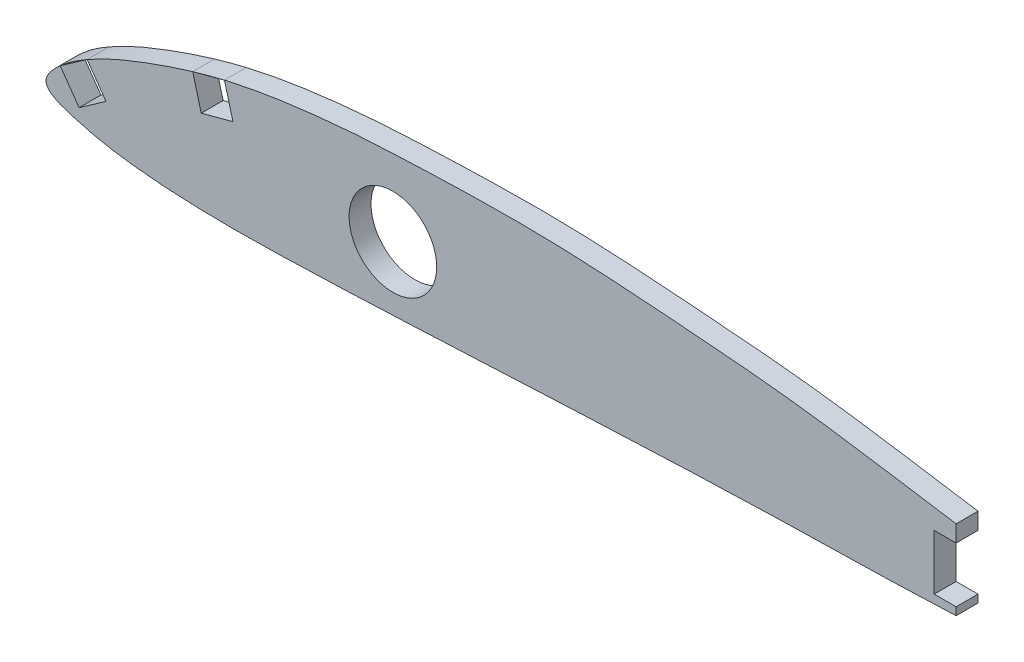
from build123d import *

# Parameters (mm, degrees)
BOSS_EXTRUDE1_DEPTH = 3.175
SKETCH1_R           = 6.35
CUT_EXTRUDE1_DEPTH  = 10


with BuildPart() as part:
    # 3DSketch1 → Boss-Extrude1 (new body)
    with BuildSketch(Plane(origin=(0, 0, 0), x_dir=(0.999981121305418, -0.006144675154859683, 0), z_dir=(0, 0, 1))):
        with BuildLine():
            add(Edge.make_bspline(
                [(0, 0), (-0.055698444, 0.966019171), (2.041050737, 3.148203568), (5.024824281, 5.313067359), (8.896258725, 7.428588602), (16.316218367, 10.50008854), (25.321932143, 13.434493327), (35.99259414, 15.208232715), (45.039943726, 16.167310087), (57.087137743, 16.746385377), (72.162542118, 17.266692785), (90.21659387, 16.111019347), (108.401858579, 14.806394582), (126.183465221, 12.069874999), (145.257463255, 9.273760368), (159.821399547, 5.941828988), (190.816250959, 0), (150.75216978, 1.164714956), (133.342814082, -0.536451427), (95.743205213, -1.360288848), (66.358712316, -3.142575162), (36.102738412, -4.647724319), (21.231058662, -4.982995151), (10.277162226, -3.989977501), (4.696184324, -2.749927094), (0.076432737, -1.325629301), (0, 0)],
                knots=[0, 0, 0, 0, 0.010560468, 0.018211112, 0.032209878, 0.045524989, 0.084069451, 0.108974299, 0.133649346, 0.158232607, 0.207343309, 0.256522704, 0.305826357, 0.355445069, 0.405214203, 0.45539047, 0.506006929, 0.555121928, 0.653369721, 0.702490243, 0.849938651, 0.899083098, 0.948194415, 0.97290595, 0.985508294, 1, 1, 1, 1], degree=3))
        make_face()
    extrude(amount=BOSS_EXTRUDE1_DEPTH)

    # Sketch1 → Cut-Extrude1 (cut)
    with BuildSketch(Plane.XY.offset(3.175)):
        with Locations((50.31, 5)):
            Circle(SKETCH1_R)
        Polygon((131.992, 0), (131.992, -9.043855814), (186.500561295, -9.043855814), (186.500561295, 16.003211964), (131.992, 16.003211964), (131.992, 8), (128.817, 8), (128.817, 0), align=None)
        Polygon((2.064406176, 2.99155451), (5.965617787, 5.723212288), (8.697275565, 1.822000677), (4.796063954, -0.909657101), align=None)
        Polygon((21.282326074, 11.855399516), (25.882547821, 13.088025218), (27.115173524, 8.487803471), (22.514951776, 7.255177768), align=None)
    extrude(amount=-CUT_EXTRUDE1_DEPTH, mode=Mode.SUBTRACT)


solid = part.part
